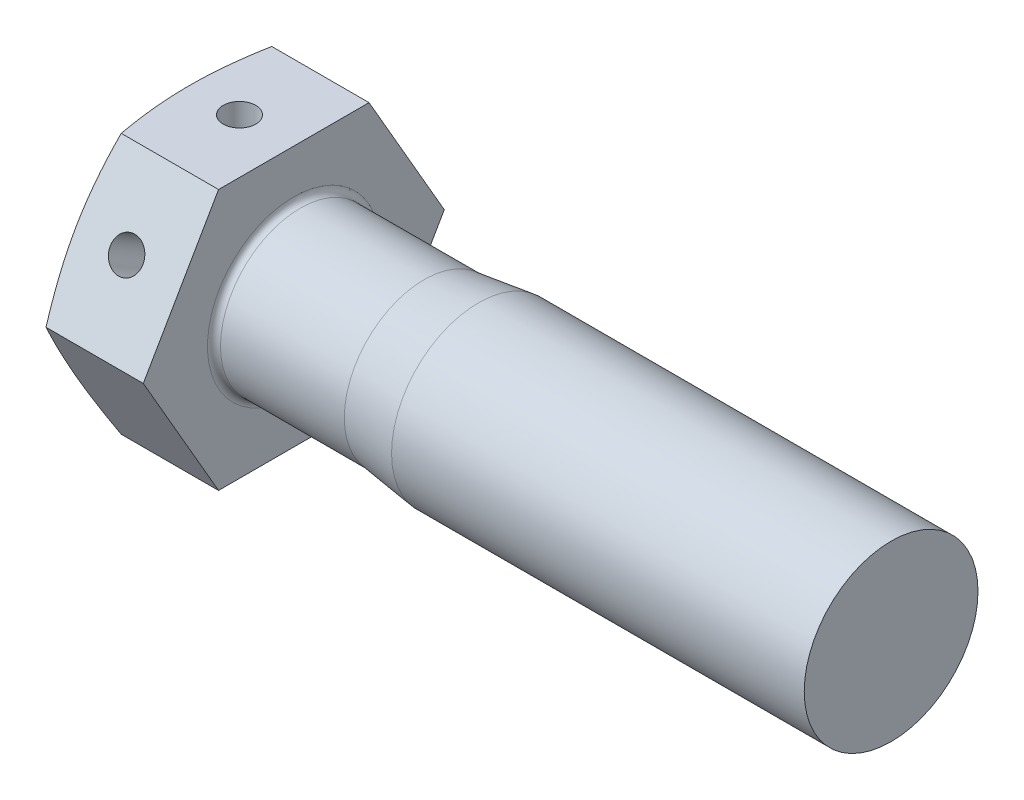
ISO-10303-21;
HEADER;
FILE_DESCRIPTION(('STEP AP214'),'2;1');
FILE_NAME('part.step','',(''),(''),'','','');
FILE_SCHEMA(('AUTOMOTIVE_DESIGN { 1 0 10303 214 1 1 1 1 }'));
ENDSEC;
DATA;
#1=APPLICATION_CONTEXT('core data for automotive mechanical design processes');
#2=APPLICATION_PROTOCOL_DEFINITION('international standard','automotive_design',2000,#1);
#3=PRODUCT_CONTEXT('',#1,'mechanical');
#4=PRODUCT('Part','Part','',(#3));
#5=PRODUCT_RELATED_PRODUCT_CATEGORY('part','',(#4));
#6=PRODUCT_DEFINITION_FORMATION('','',#4);
#7=PRODUCT_DEFINITION_CONTEXT('part definition',#1,'design');
#8=PRODUCT_DEFINITION('design','',#6,#7);
#9=PRODUCT_DEFINITION_SHAPE('','',#8);
#10=(LENGTH_UNIT() NAMED_UNIT(*) SI_UNIT(.MILLI.,.METRE.));
#11=(NAMED_UNIT(*) PLANE_ANGLE_UNIT() SI_UNIT($,.RADIAN.));
#12=(NAMED_UNIT(*) SI_UNIT($,.STERADIAN.) SOLID_ANGLE_UNIT());
#13=UNCERTAINTY_MEASURE_WITH_UNIT(LENGTH_MEASURE(1.E-05),#10,'distance_accuracy_value','');
#14=(GEOMETRIC_REPRESENTATION_CONTEXT(3) GLOBAL_UNCERTAINTY_ASSIGNED_CONTEXT((#13)) GLOBAL_UNIT_ASSIGNED_CONTEXT((#10,
#11,#12)) REPRESENTATION_CONTEXT('',''));
#15=CARTESIAN_POINT('',(0.,0.,0.));
#16=DIRECTION('',(0.,0.,1.));
#17=DIRECTION('',(1.,0.,0.));
#18=AXIS2_PLACEMENT_3D('',#15,#16,#17);
#19=CARTESIAN_POINT('',(5.,-12.,0.));
#20=DIRECTION('',(0.,1.,0.));
#21=DIRECTION('',(0.,0.,1.));
#22=AXIS2_PLACEMENT_3D('',#19,#20,#21);
#23=CYLINDRICAL_SURFACE('',#22,1.5);
#24=CARTESIAN_POINT('',(5.,12.0000000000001,0.));
#25=DIRECTION('',(0.,1.,0.));
#26=DIRECTION('',(0.,0.,1.));
#27=AXIS2_PLACEMENT_3D('',#24,#25,#26);
#28=CIRCLE('',#27,1.5);
#29=CARTESIAN_POINT('',(5.,12.0000000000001,1.5));
#30=VERTEX_POINT('',#29);
#31=EDGE_CURVE('E267',#30,#30,#28,.T.);
#32=ORIENTED_EDGE('',*,*,#31,.T.);
#33=EDGE_LOOP('',(#32));
#34=FACE_BOUND('',#33,.T.);
#35=CARTESIAN_POINT('',(5.,0.,0.));
#36=DIRECTION('',(0.,0.500000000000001,-0.866025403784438));
#37=DIRECTION('',(0.,0.866025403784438,0.500000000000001));
#38=AXIS2_PLACEMENT_3D('',#35,#36,#37);
#39=ELLIPSE('',#38,3.,1.5);
#40=CARTESIAN_POINT('',(6.5,0.,0.));
#41=VERTEX_POINT('',#40);
#42=CARTESIAN_POINT('',(3.5,0.,0.));
#43=VERTEX_POINT('',#42);
#44=EDGE_CURVE('E46',#41,#43,#39,.F.);
#45=ORIENTED_EDGE('',*,*,#44,.T.);
#46=CARTESIAN_POINT('',(5.,0.,0.));
#47=DIRECTION('',(0.,0.866025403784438,0.500000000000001));
#48=DIRECTION('',(0.,0.500000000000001,-0.866025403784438));
#49=AXIS2_PLACEMENT_3D('',#46,#47,#48);
#50=ELLIPSE('',#49,1.73205080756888,1.5);
#51=EDGE_CURVE('E11',#43,#41,#50,.F.);
#52=ORIENTED_EDGE('',*,*,#51,.T.);
#53=EDGE_LOOP('',(#45,#52));
#54=FACE_BOUND('',#53,.T.);
#55=ADVANCED_FACE('F32',(#34,#54),#23,.F.);
#56=CARTESIAN_POINT('',(10.,-12.,-6.92820323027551));
#57=DIRECTION('',(0.,0.5,0.866025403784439));
#58=DIRECTION('',(0.,-0.866025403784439,0.5));
#59=AXIS2_PLACEMENT_3D('',#56,#57,#58);
#60=PLANE('',#59);
#61=CARTESIAN_POINT('',(5.,-5.99999999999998,-10.3923048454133));
#62=DIRECTION('',(0.,0.5,0.866025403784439));
#63=DIRECTION('',(0.,-0.866025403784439,0.5));
#64=AXIS2_PLACEMENT_3D('',#61,#62,#63);
#65=CIRCLE('',#64,1.5);
#66=CARTESIAN_POINT('',(5.,-7.29903810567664,-9.64230484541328));
#67=VERTEX_POINT('',#66);
#68=EDGE_CURVE('E269',#67,#67,#65,.T.);
#69=ORIENTED_EDGE('',*,*,#68,.T.);
#70=EDGE_LOOP('',(#69));
#71=FACE_BOUND('',#70,.T.);
#72=CARTESIAN_POINT('',(1.03968895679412,0.000200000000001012,-13.8565219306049));
#73=CARTESIAN_POINT('',(0.935221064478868,-0.496762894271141,-13.5696002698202));
#74=CARTESIAN_POINT('',(0.840189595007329,-0.995364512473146,-13.2817324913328));
#75=CARTESIAN_POINT('',(0.672996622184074,-1.99580957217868,-12.7041252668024));
#76=CARTESIAN_POINT('',(0.600853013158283,-2.49765523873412,-12.414384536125));
#77=CARTESIAN_POINT('',(0.484162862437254,-3.49901930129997,-11.8362467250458));
#78=CARTESIAN_POINT('',(0.439361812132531,-3.99851483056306,-11.5478628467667));
#79=CARTESIAN_POINT('',(0.379271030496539,-4.99867391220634,-10.9704207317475));
#80=CARTESIAN_POINT('',(0.363970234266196,-5.49933695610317,-10.6813627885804));
#81=CARTESIAN_POINT('',(0.363970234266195,-6.50066304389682,-10.1032469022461));
#82=CARTESIAN_POINT('',(0.379271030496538,-7.00132608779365,-9.81418895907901));
#83=CARTESIAN_POINT('',(0.439361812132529,-8.00148516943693,-9.23674684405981));
#84=CARTESIAN_POINT('',(0.484162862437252,-8.50098069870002,-8.94836296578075));
#85=CARTESIAN_POINT('',(0.600853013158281,-9.50234476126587,-8.37022515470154));
#86=CARTESIAN_POINT('',(0.672996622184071,-10.0041904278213,-8.08048442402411));
#87=CARTESIAN_POINT('',(0.840189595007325,-11.0046354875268,-7.50287719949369));
#88=CARTESIAN_POINT('',(0.935221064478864,-11.5032371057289,-7.21500942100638));
#89=CARTESIAN_POINT('',(1.03968895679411,-12.0002,-6.92808776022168));
#90=B_SPLINE_CURVE_WITH_KNOTS('',3,(#72,#73,#74,#75,#76,#77,#78,#79,#80,#81,#82,#83,#84,#85,#86,
#87,#88,#89),.UNSPECIFIED.,.F.,.F.,(4,2,2,2,2,2,2,2,4),(0.,1.75000540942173,3.50137566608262,
5.23618486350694,6.97034324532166,8.70450162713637,10.4393108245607,12.1906810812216,
13.9406864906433),.UNSPECIFIED.);
#91=CARTESIAN_POINT('',(1.03964692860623,0.,-13.856406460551));
#92=VERTEX_POINT('',#91);
#93=CARTESIAN_POINT('',(1.03964692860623,-12.,-6.92820323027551));
#94=VERTEX_POINT('',#93);
#95=EDGE_CURVE('E54',#92,#94,#90,.T.);
#96=ORIENTED_EDGE('',*,*,#95,.F.);
#97=DIRECTION('',(-1.,0.,0.));
#98=VECTOR('',#97,1.);
#99=CARTESIAN_POINT('',(10.,0.,-13.856406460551));
#100=LINE('',#99,#98);
#101=CARTESIAN_POINT('',(10.,0.,-13.856406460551));
#102=VERTEX_POINT('',#101);
#103=EDGE_CURVE('E111',#102,#92,#100,.T.);
#104=ORIENTED_EDGE('',*,*,#103,.F.);
#105=DIRECTION('',(0.,0.866025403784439,-0.5));
#106=VECTOR('',#105,1.);
#107=CARTESIAN_POINT('',(10.,-12.,-6.92820323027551));
#108=LINE('',#107,#106);
#109=CARTESIAN_POINT('',(10.,-12.,-6.92820323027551));
#110=VERTEX_POINT('',#109);
#111=EDGE_CURVE('E139',#110,#102,#108,.T.);
#112=ORIENTED_EDGE('',*,*,#111,.F.);
#113=DIRECTION('',(-1.,0.,0.));
#114=VECTOR('',#113,1.);
#115=CARTESIAN_POINT('',(10.,-12.,-6.92820323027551));
#116=LINE('',#115,#114);
#117=EDGE_CURVE('E126',#110,#94,#116,.T.);
#118=ORIENTED_EDGE('',*,*,#117,.T.);
#119=EDGE_LOOP('',(#96,#104,#112,#118));
#120=FACE_BOUND('',#119,.T.);
#121=ADVANCED_FACE('F34',(#71,#120),#60,.F.);
#122=CARTESIAN_POINT('',(10.,0.,-13.856406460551));
#123=DIRECTION('',(0.,-0.5,0.866025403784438));
#124=DIRECTION('',(0.,-0.866025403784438,-0.5));
#125=AXIS2_PLACEMENT_3D('',#122,#123,#124);
#126=PLANE('',#125);
#127=CARTESIAN_POINT('',(1.03968895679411,12.0002,-6.92808776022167));
#128=CARTESIAN_POINT('',(0.935221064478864,11.5032371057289,-7.21500942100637));
#129=CARTESIAN_POINT('',(0.840189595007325,11.0046354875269,-7.50287719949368));
#130=CARTESIAN_POINT('',(0.672996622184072,10.0041904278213,-8.0804844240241));
#131=CARTESIAN_POINT('',(0.600853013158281,9.50234476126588,-8.37022515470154));
#132=CARTESIAN_POINT('',(0.484162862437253,8.50098069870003,-8.94836296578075));
#133=CARTESIAN_POINT('',(0.439361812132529,8.00148516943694,-9.23674684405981));
#134=CARTESIAN_POINT('',(0.379271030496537,7.00132608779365,-9.814188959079));
#135=CARTESIAN_POINT('',(0.363970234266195,6.50066304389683,-10.1032469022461));
#136=CARTESIAN_POINT('',(0.363970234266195,5.49933695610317,-10.6813627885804));
#137=CARTESIAN_POINT('',(0.379271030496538,4.99867391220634,-10.9704207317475));
#138=CARTESIAN_POINT('',(0.43936181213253,3.99851483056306,-11.5478628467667));
#139=CARTESIAN_POINT('',(0.484162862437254,3.49901930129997,-11.8362467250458));
#140=CARTESIAN_POINT('',(0.600853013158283,2.49765523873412,-12.414384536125));
#141=CARTESIAN_POINT('',(0.672996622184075,1.99580957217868,-12.7041252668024));
#142=CARTESIAN_POINT('',(0.840189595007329,0.995364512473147,-13.2817324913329));
#143=CARTESIAN_POINT('',(0.935221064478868,0.496762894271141,-13.5696002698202));
#144=CARTESIAN_POINT('',(1.03968895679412,-0.000200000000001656,-13.8565219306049));
#145=B_SPLINE_CURVE_WITH_KNOTS('',3,(#127,#128,#129,#130,#131,#132,#133,#134,#135,#136,#137,
#138,#139,#140,#141,#142,#143,#144),.UNSPECIFIED.,.F.,.F.,(4,2,2,2,2,2,2,2,4),(0.,
1.75000540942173,3.50137566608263,5.23618486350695,6.97034324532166,8.70450162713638,
10.4393108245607,12.1906810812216,13.9406864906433),.UNSPECIFIED.);
#146=CARTESIAN_POINT('',(1.03964692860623,12.,-6.92820323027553));
#147=VERTEX_POINT('',#146);
#148=EDGE_CURVE('E150',#147,#92,#145,.T.);
#149=ORIENTED_EDGE('',*,*,#148,.F.);
#150=DIRECTION('',(-1.,0.,0.));
#151=VECTOR('',#150,1.);
#152=CARTESIAN_POINT('',(10.,12.,-6.92820323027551));
#153=LINE('',#152,#151);
#154=CARTESIAN_POINT('',(10.,12.,-6.92820323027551));
#155=VERTEX_POINT('',#154);
#156=EDGE_CURVE('E114',#155,#147,#153,.T.);
#157=ORIENTED_EDGE('',*,*,#156,.F.);
#158=DIRECTION('',(0.,0.866025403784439,0.5));
#159=VECTOR('',#158,1.);
#160=CARTESIAN_POINT('',(10.,0.,-13.856406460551));
#161=LINE('',#160,#159);
#162=EDGE_CURVE('E137',#102,#155,#161,.T.);
#163=ORIENTED_EDGE('',*,*,#162,.F.);
#164=ORIENTED_EDGE('',*,*,#103,.T.);
#165=EDGE_LOOP('',(#149,#157,#163,#164));
#166=FACE_BOUND('',#165,.T.);
#167=ADVANCED_FACE('F200',(#166),#126,.F.);
#168=CARTESIAN_POINT('',(10.,12.,-6.92820323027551));
#169=DIRECTION('',(0.,-1.,0.));
#170=DIRECTION('',(0.,0.,-1.));
#171=AXIS2_PLACEMENT_3D('',#168,#169,#170);
#172=PLANE('',#171);
#173=ORIENTED_EDGE('',*,*,#31,.F.);
#174=EDGE_LOOP('',(#173));
#175=FACE_BOUND('',#174,.T.);
#176=CARTESIAN_POINT('',(3.96396734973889,12.,-18.3087950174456));
#177=CARTESIAN_POINT('',(3.79884886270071,12.,-17.7662249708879));
#178=CARTESIAN_POINT('',(3.63566479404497,12.,-17.2230552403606));
#179=CARTESIAN_POINT('',(3.31423573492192,12.,-16.1352111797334));
#180=CARTESIAN_POINT('',(3.15599113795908,12.,-15.5905367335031));
#181=CARTESIAN_POINT('',(2.84524590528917,12.,-14.4984381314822));
#182=CARTESIAN_POINT('',(2.69275663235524,12.,-13.951010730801));
#183=CARTESIAN_POINT('',(2.39531632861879,12.,-12.8541146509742));
#184=CARTESIAN_POINT('',(2.25036516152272,12.,-12.304646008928));
#185=CARTESIAN_POINT('',(1.97161365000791,12.,-11.2101580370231));
#186=CARTESIAN_POINT('',(1.83769693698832,12.,-10.6651684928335));
#187=CARTESIAN_POINT('',(1.58131725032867,12.,-9.57247358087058));
#188=CARTESIAN_POINT('',(1.45885446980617,12.,-9.02476816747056));
#189=CARTESIAN_POINT('',(1.22824895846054,12.,-7.92652528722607));
#190=CARTESIAN_POINT('',(1.12010122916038,12.,-7.37598887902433));
#191=CARTESIAN_POINT('',(0.921428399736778,12.,-6.2717216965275));
#192=CARTESIAN_POINT('',(0.83090270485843,12.,-5.71799103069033));
#193=CARTESIAN_POINT('',(0.680125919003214,12.,-4.66974970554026));
#194=CARTESIAN_POINT('',(0.617617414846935,12.,-4.17556679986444));
#195=CARTESIAN_POINT('',(0.511920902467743,12.,-3.18512193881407));
#196=CARTESIAN_POINT('',(0.468732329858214,12.,-2.68886004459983));
#197=CARTESIAN_POINT('',(0.403756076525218,12.,-1.69526447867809));
#198=CARTESIAN_POINT('',(0.381953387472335,12.,-1.19793180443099));
#199=CARTESIAN_POINT('',(0.360851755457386,12.,-0.202784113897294));
#200=CARTESIAN_POINT('',(0.361552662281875,12.,0.295030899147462));
#201=CARTESIAN_POINT('',(0.385481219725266,12.,1.29266481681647));
#202=CARTESIAN_POINT('',(0.40882438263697,12.,1.79248090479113));
#203=CARTESIAN_POINT('',(0.476964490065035,12.,2.79063583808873));
#204=CARTESIAN_POINT('',(0.521761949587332,12.,3.28897464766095));
#205=CARTESIAN_POINT('',(0.630722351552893,12.,4.28393280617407));
#206=CARTESIAN_POINT('',(0.694901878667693,12.,4.78055031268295));
#207=CARTESIAN_POINT('',(0.8400332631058,12.,5.7713005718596));
#208=CARTESIAN_POINT('',(0.920985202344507,12.,6.26543331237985));
#209=CARTESIAN_POINT('',(1.10220294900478,12.,7.28006763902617));
#210=CARTESIAN_POINT('',(1.2033232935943,12.,7.80041525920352));
#211=CARTESIAN_POINT('',(1.41857818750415,12.,8.83842892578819));
#212=CARTESIAN_POINT('',(1.53271372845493,12.,9.35609476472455));
#213=CARTESIAN_POINT('',(1.77159173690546,12.,10.3891186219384));
#214=CARTESIAN_POINT('',(1.89633731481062,12.,10.904475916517));
#215=CARTESIAN_POINT('',(2.15439952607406,12.,11.9330162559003));
#216=CARTESIAN_POINT('',(2.28771595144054,12.,12.4461993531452));
#217=CARTESIAN_POINT('',(2.56148831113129,12.,13.4713608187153));
#218=CARTESIAN_POINT('',(2.70195324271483,12.,13.9833367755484));
#219=CARTESIAN_POINT('',(2.98857841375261,12.,15.0056897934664));
#220=CARTESIAN_POINT('',(3.1347386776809,12.,15.5160668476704));
#221=CARTESIAN_POINT('',(3.43170649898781,12.,16.5353680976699));
#222=CARTESIAN_POINT('',(3.58251324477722,12.,17.0442925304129));
#223=CARTESIAN_POINT('',(3.88799531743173,12.,18.0609803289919));
#224=CARTESIAN_POINT('',(4.04267066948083,12.,18.5687436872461));
#225=CARTESIAN_POINT('',(4.5079543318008,12.,20.0790517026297));
#226=CARTESIAN_POINT('',(4.82321954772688,12.,21.0801614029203));
#227=CARTESIAN_POINT('',(5.46263375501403,12.,23.0795787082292));
#228=CARTESIAN_POINT('',(5.78678317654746,12.,24.0778861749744));
#229=CARTESIAN_POINT('',(6.44034806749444,12.,26.0685686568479));
#230=CARTESIAN_POINT('',(6.76973882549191,12.,27.0609517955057));
#231=CARTESIAN_POINT('',(7.26745556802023,12.,28.5482638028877));
#232=CARTESIAN_POINT('',(7.43395945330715,12.,29.0438040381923));
#233=CARTESIAN_POINT('',(7.768037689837,12.,30.0345222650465));
#234=CARTESIAN_POINT('',(7.93561203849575,12.,30.5297002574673));
#235=CARTESIAN_POINT('',(8.10365001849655,12.,31.02472094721));
#236=B_SPLINE_CURVE_WITH_KNOTS('',3,(#176,#177,#178,#179,#180,#181,#182,#183,#184,#185,#186,
#187,#188,#189,#190,#191,#192,#193,#194,#195,#196,#197,#198,#199,#200,#201,#202,#203,#204,#205,
#206,#207,#208,#209,#210,#211,#212,#213,#214,#215,#216,#217,#218,#219,#220,#221,#222,#223,#224,
#225,#226,#227,#228,#229,#230,#231,#232,#233,#234,#235),.UNSPECIFIED.,.F.,.F.,(4,2,2,2,2,2,2,2,
2,2,2,2,2,2,2,2,2,2,2,2,2,2,2,2,2,2,2,2,2,4),(0.,1.70142841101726,3.40299202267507,
5.10775586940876,6.81248888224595,8.49599601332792,10.1795315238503,11.8624776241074,
13.5453669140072,15.0393995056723,16.5333884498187,18.0263281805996,19.5192579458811,
21.019844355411,22.5204667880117,24.0223769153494,25.524294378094,27.1143358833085,
28.7044986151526,30.2951291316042,31.8857210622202,33.4783669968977,35.0710197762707,
36.6633959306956,38.2557824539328,41.4044472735,44.5532648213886,47.6901088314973,
49.2584041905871,50.8266957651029),.UNSPECIFIED.);
#237=CARTESIAN_POINT('',(1.03964692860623,12.0000000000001,6.92820323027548));
#238=VERTEX_POINT('',#237);
#239=EDGE_CURVE('E191',#238,#147,#236,.F.);
#240=ORIENTED_EDGE('',*,*,#239,.F.);
#241=DIRECTION('',(-1.,0.,0.));
#242=VECTOR('',#241,1.);
#243=CARTESIAN_POINT('',(10.,12.,6.92820323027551));
#244=LINE('',#243,#242);
#245=CARTESIAN_POINT('',(10.,12.,6.92820323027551));
#246=VERTEX_POINT('',#245);
#247=EDGE_CURVE('E117',#246,#238,#244,.T.);
#248=ORIENTED_EDGE('',*,*,#247,.F.);
#249=DIRECTION('',(0.,0.,1.));
#250=VECTOR('',#249,1.);
#251=CARTESIAN_POINT('',(10.,12.,-6.92820323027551));
#252=LINE('',#251,#250);
#253=EDGE_CURVE('E135',#155,#246,#252,.T.);
#254=ORIENTED_EDGE('',*,*,#253,.F.);
#255=ORIENTED_EDGE('',*,*,#156,.T.);
#256=EDGE_LOOP('',(#240,#248,#254,#255));
#257=FACE_BOUND('',#256,.T.);
#258=ADVANCED_FACE('F196',(#175,#257),#172,.F.);
#259=CARTESIAN_POINT('',(10.,12.,6.92820323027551));
#260=DIRECTION('',(0.,-0.5,-0.866025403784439));
#261=DIRECTION('',(0.,0.866025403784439,-0.5));
#262=AXIS2_PLACEMENT_3D('',#259,#260,#261);
#263=PLANE('',#262);
#264=CARTESIAN_POINT('',(5.,5.99999999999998,10.3923048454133));
#265=DIRECTION('',(0.,-0.5,-0.866025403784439));
#266=DIRECTION('',(0.,0.866025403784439,-0.5));
#267=AXIS2_PLACEMENT_3D('',#264,#265,#266);
#268=CIRCLE('',#267,1.5);
#269=CARTESIAN_POINT('',(5.,7.29903810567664,9.64230484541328));
#270=VERTEX_POINT('',#269);
#271=EDGE_CURVE('E272',#270,#270,#268,.T.);
#272=ORIENTED_EDGE('',*,*,#271,.T.);
#273=EDGE_LOOP('',(#272));
#274=FACE_BOUND('',#273,.T.);
#275=CARTESIAN_POINT('',(1.03968895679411,-0.000199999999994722,13.8565219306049));
#276=CARTESIAN_POINT('',(0.935221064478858,0.496762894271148,13.5696002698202));
#277=CARTESIAN_POINT('',(0.840189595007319,0.995364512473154,13.2817324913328));
#278=CARTESIAN_POINT('',(0.672996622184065,1.99580957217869,12.7041252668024));
#279=CARTESIAN_POINT('',(0.600853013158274,2.49765523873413,12.414384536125));
#280=CARTESIAN_POINT('',(0.484162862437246,3.49901930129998,11.8362467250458));
#281=CARTESIAN_POINT('',(0.439361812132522,3.99851483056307,11.5478628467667));
#282=CARTESIAN_POINT('',(0.37927103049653,4.99867391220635,10.9704207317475));
#283=CARTESIAN_POINT('',(0.363970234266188,5.49933695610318,10.6813627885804));
#284=CARTESIAN_POINT('',(0.363970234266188,6.50066304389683,10.1032469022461));
#285=CARTESIAN_POINT('',(0.379271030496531,7.00132608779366,9.814188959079));
#286=CARTESIAN_POINT('',(0.439361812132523,8.00148516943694,9.23674684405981));
#287=CARTESIAN_POINT('',(0.484162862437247,8.50098069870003,8.94836296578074));
#288=CARTESIAN_POINT('',(0.600853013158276,9.50234476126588,8.37022515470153));
#289=CARTESIAN_POINT('',(0.672996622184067,10.0041904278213,8.0804844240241));
#290=CARTESIAN_POINT('',(0.840189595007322,11.0046354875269,7.50287719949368));
#291=CARTESIAN_POINT('',(0.935221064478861,11.5032371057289,7.21500942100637));
#292=CARTESIAN_POINT('',(1.03968895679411,12.0002,6.92808776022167));
#293=B_SPLINE_CURVE_WITH_KNOTS('',3,(#275,#276,#277,#278,#279,#280,#281,#282,#283,#284,#285,
#286,#287,#288,#289,#290,#291,#292),.UNSPECIFIED.,.F.,.F.,(4,2,2,2,2,2,2,2,4),(0.,
1.75000540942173,3.50137566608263,5.23618486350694,6.97034324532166,8.70450162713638,
10.4393108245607,12.1906810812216,13.9406864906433),.UNSPECIFIED.);
#294=CARTESIAN_POINT('',(1.03964692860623,0.,13.8564064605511));
#295=VERTEX_POINT('',#294);
#296=EDGE_CURVE('E186',#295,#238,#293,.T.);
#297=ORIENTED_EDGE('',*,*,#296,.F.);
#298=DIRECTION('',(-1.,0.,0.));
#299=VECTOR('',#298,1.);
#300=CARTESIAN_POINT('',(10.,0.,13.856406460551));
#301=LINE('',#300,#299);
#302=CARTESIAN_POINT('',(10.,0.,13.856406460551));
#303=VERTEX_POINT('',#302);
#304=EDGE_CURVE('E120',#303,#295,#301,.T.);
#305=ORIENTED_EDGE('',*,*,#304,.F.);
#306=DIRECTION('',(0.,-0.866025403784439,0.5));
#307=VECTOR('',#306,1.);
#308=CARTESIAN_POINT('',(10.,12.,6.92820323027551));
#309=LINE('',#308,#307);
#310=EDGE_CURVE('E133',#246,#303,#309,.T.);
#311=ORIENTED_EDGE('',*,*,#310,.F.);
#312=ORIENTED_EDGE('',*,*,#247,.T.);
#313=EDGE_LOOP('',(#297,#305,#311,#312));
#314=FACE_BOUND('',#313,.T.);
#315=ADVANCED_FACE('F199',(#274,#314),#263,.F.);
#316=CARTESIAN_POINT('',(10.,0.,13.856406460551));
#317=DIRECTION('',(0.,0.5,-0.866025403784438));
#318=DIRECTION('',(0.,0.866025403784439,0.5));
#319=AXIS2_PLACEMENT_3D('',#316,#317,#318);
#320=PLANE('',#319);
#321=CARTESIAN_POINT('',(1.03968895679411,-12.0002,6.92808776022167));
#322=CARTESIAN_POINT('',(0.935221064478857,-11.5032371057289,7.21500942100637));
#323=CARTESIAN_POINT('',(0.840189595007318,-11.0046354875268,7.50287719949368));
#324=CARTESIAN_POINT('',(0.672996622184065,-10.0041904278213,8.0804844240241));
#325=CARTESIAN_POINT('',(0.600853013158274,-9.50234476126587,8.37022515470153));
#326=CARTESIAN_POINT('',(0.484162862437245,-8.50098069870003,8.94836296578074));
#327=CARTESIAN_POINT('',(0.43936181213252,-8.00148516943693,9.2367468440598));
#328=CARTESIAN_POINT('',(0.379271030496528,-7.00132608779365,9.814188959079));
#329=CARTESIAN_POINT('',(0.363970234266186,-6.50066304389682,10.1032469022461));
#330=CARTESIAN_POINT('',(0.363970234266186,-5.49933695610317,10.6813627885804));
#331=CARTESIAN_POINT('',(0.379271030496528,-4.99867391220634,10.9704207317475));
#332=CARTESIAN_POINT('',(0.43936181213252,-3.99851483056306,11.5478628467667));
#333=CARTESIAN_POINT('',(0.484162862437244,-3.49901930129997,11.8362467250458));
#334=CARTESIAN_POINT('',(0.600853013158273,-2.49765523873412,12.414384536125));
#335=CARTESIAN_POINT('',(0.672996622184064,-1.99580957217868,12.7041252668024));
#336=CARTESIAN_POINT('',(0.840189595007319,-0.995364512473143,13.2817324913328));
#337=CARTESIAN_POINT('',(0.935221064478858,-0.496762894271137,13.5696002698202));
#338=CARTESIAN_POINT('',(1.03968895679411,0.000200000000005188,13.8565219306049));
#339=B_SPLINE_CURVE_WITH_KNOTS('',3,(#321,#322,#323,#324,#325,#326,#327,#328,#329,#330,#331,
#332,#333,#334,#335,#336,#337,#338),.UNSPECIFIED.,.F.,.F.,(4,2,2,2,2,2,2,2,4),(0.,
1.75000540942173,3.50137566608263,5.23618486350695,6.97034324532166,8.70450162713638,
10.4393108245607,12.1906810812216,13.9406864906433),.UNSPECIFIED.);
#340=CARTESIAN_POINT('',(1.03964692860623,-12.,6.92820323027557));
#341=VERTEX_POINT('',#340);
#342=EDGE_CURVE('E179',#341,#295,#339,.T.);
#343=ORIENTED_EDGE('',*,*,#342,.F.);
#344=DIRECTION('',(-1.,0.,0.));
#345=VECTOR('',#344,1.);
#346=CARTESIAN_POINT('',(10.,-12.,6.9282032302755));
#347=LINE('',#346,#345);
#348=CARTESIAN_POINT('',(10.,-12.,6.9282032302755));
#349=VERTEX_POINT('',#348);
#350=EDGE_CURVE('E123',#349,#341,#347,.T.);
#351=ORIENTED_EDGE('',*,*,#350,.F.);
#352=DIRECTION('',(0.,-0.866025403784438,-0.5));
#353=VECTOR('',#352,1.);
#354=CARTESIAN_POINT('',(10.,0.,13.856406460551));
#355=LINE('',#354,#353);
#356=EDGE_CURVE('E131',#303,#349,#355,.T.);
#357=ORIENTED_EDGE('',*,*,#356,.F.);
#358=ORIENTED_EDGE('',*,*,#304,.T.);
#359=EDGE_LOOP('',(#343,#351,#357,#358));
#360=FACE_BOUND('',#359,.T.);
#361=ADVANCED_FACE('F278',(#360),#320,.F.);
#362=CARTESIAN_POINT('',(10.,-12.,6.9282032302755));
#363=DIRECTION('',(0.,1.,0.));
#364=DIRECTION('',(0.,0.,1.));
#365=AXIS2_PLACEMENT_3D('',#362,#363,#364);
#366=PLANE('',#365);
#367=CARTESIAN_POINT('',(5.,-12.,0.));
#368=DIRECTION('',(0.,1.,0.));
#369=DIRECTION('',(0.,0.,1.));
#370=AXIS2_PLACEMENT_3D('',#367,#368,#369);
#371=CIRCLE('',#370,1.5);
#372=CARTESIAN_POINT('',(5.,-12.,1.5));
#373=VERTEX_POINT('',#372);
#374=EDGE_CURVE('E264',#373,#373,#371,.T.);
#375=ORIENTED_EDGE('',*,*,#374,.T.);
#376=EDGE_LOOP('',(#375));
#377=FACE_BOUND('',#376,.T.);
#378=CARTESIAN_POINT('',(3.96396734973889,-12.,-18.3087950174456));
#379=CARTESIAN_POINT('',(3.79884886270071,-12.,-17.7662249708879));
#380=CARTESIAN_POINT('',(3.63566479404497,-12.,-17.2230552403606));
#381=CARTESIAN_POINT('',(3.31423573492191,-12.,-16.1352111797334));
#382=CARTESIAN_POINT('',(3.15599113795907,-12.,-15.5905367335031));
#383=CARTESIAN_POINT('',(2.84524590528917,-12.,-14.4984381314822));
#384=CARTESIAN_POINT('',(2.69275663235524,-12.,-13.9510107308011));
#385=CARTESIAN_POINT('',(2.39531632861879,-12.,-12.8541146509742));
#386=CARTESIAN_POINT('',(2.25036516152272,-12.,-12.304646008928));
#387=CARTESIAN_POINT('',(1.97161365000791,-12.,-11.2101580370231));
#388=CARTESIAN_POINT('',(1.83769693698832,-12.,-10.6651684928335));
#389=CARTESIAN_POINT('',(1.58131725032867,-12.,-9.57247358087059));
#390=CARTESIAN_POINT('',(1.45885446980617,-12.,-9.02476816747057));
#391=CARTESIAN_POINT('',(1.22824895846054,-12.,-7.92652528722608));
#392=CARTESIAN_POINT('',(1.12010122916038,-12.,-7.37598887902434));
#393=CARTESIAN_POINT('',(0.921428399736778,-12.,-6.27172169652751));
#394=CARTESIAN_POINT('',(0.83090270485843,-12.,-5.71799103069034));
#395=CARTESIAN_POINT('',(0.680125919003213,-12.,-4.66974970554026));
#396=CARTESIAN_POINT('',(0.617617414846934,-12.,-4.17556679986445));
#397=CARTESIAN_POINT('',(0.511920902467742,-12.,-3.18512193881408));
#398=CARTESIAN_POINT('',(0.468732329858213,-12.,-2.68886004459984));
#399=CARTESIAN_POINT('',(0.403756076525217,-12.,-1.6952644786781));
#400=CARTESIAN_POINT('',(0.381953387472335,-12.,-1.197931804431));
#401=CARTESIAN_POINT('',(0.360851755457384,-12.,-0.202784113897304));
#402=CARTESIAN_POINT('',(0.361552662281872,-12.,0.295030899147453));
#403=CARTESIAN_POINT('',(0.385481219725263,-12.,1.29266481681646));
#404=CARTESIAN_POINT('',(0.408824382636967,-12.,1.79248090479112));
#405=CARTESIAN_POINT('',(0.476964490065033,-12.,2.79063583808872));
#406=CARTESIAN_POINT('',(0.521761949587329,-12.,3.28897464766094));
#407=CARTESIAN_POINT('',(0.63072235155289,-12.,4.28393280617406));
#408=CARTESIAN_POINT('',(0.694901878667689,-12.,4.78055031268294));
#409=CARTESIAN_POINT('',(0.840033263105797,-12.,5.77130057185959));
#410=CARTESIAN_POINT('',(0.920985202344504,-12.,6.26543331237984));
#411=CARTESIAN_POINT('',(1.10220294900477,-12.,7.28006763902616));
#412=CARTESIAN_POINT('',(1.20332329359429,-12.,7.80041525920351));
#413=CARTESIAN_POINT('',(1.41857818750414,-12.,8.83842892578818));
#414=CARTESIAN_POINT('',(1.53271372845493,-12.,9.35609476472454));
#415=CARTESIAN_POINT('',(1.77159173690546,-12.,10.3891186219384));
#416=CARTESIAN_POINT('',(1.89633731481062,-12.,10.904475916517));
#417=CARTESIAN_POINT('',(2.15439952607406,-12.,11.9330162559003));
#418=CARTESIAN_POINT('',(2.28771595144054,-12.,12.4461993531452));
#419=CARTESIAN_POINT('',(2.56148831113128,-12.,13.4713608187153));
#420=CARTESIAN_POINT('',(2.70195324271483,-12.,13.9833367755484));
#421=CARTESIAN_POINT('',(2.9885784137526,-12.,15.0056897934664));
#422=CARTESIAN_POINT('',(3.1347386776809,-12.,15.5160668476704));
#423=CARTESIAN_POINT('',(3.4317064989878,-12.,16.5353680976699));
#424=CARTESIAN_POINT('',(3.58251324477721,-12.,17.0442925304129));
#425=CARTESIAN_POINT('',(3.88799531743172,-12.,18.0609803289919));
#426=CARTESIAN_POINT('',(4.04267066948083,-12.,18.568743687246));
#427=CARTESIAN_POINT('',(4.5079543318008,-12.,20.0790517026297));
#428=CARTESIAN_POINT('',(4.82321954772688,-12.,21.0801614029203));
#429=CARTESIAN_POINT('',(5.46263375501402,-12.,23.0795787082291));
#430=CARTESIAN_POINT('',(5.78678317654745,-12.,24.0778861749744));
#431=CARTESIAN_POINT('',(6.44034806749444,-12.,26.0685686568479));
#432=CARTESIAN_POINT('',(6.7697388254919,-12.,27.0609517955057));
#433=CARTESIAN_POINT('',(7.26745556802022,-12.,28.5482638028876));
#434=CARTESIAN_POINT('',(7.43395945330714,-12.,29.0438040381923));
#435=CARTESIAN_POINT('',(7.768037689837,-12.,30.0345222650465));
#436=CARTESIAN_POINT('',(7.93561203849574,-12.,30.5297002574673));
#437=CARTESIAN_POINT('',(8.10365001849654,-12.,31.02472094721));
#438=B_SPLINE_CURVE_WITH_KNOTS('',3,(#378,#379,#380,#381,#382,#383,#384,#385,#386,#387,#388,
#389,#390,#391,#392,#393,#394,#395,#396,#397,#398,#399,#400,#401,#402,#403,#404,#405,#406,#407,
#408,#409,#410,#411,#412,#413,#414,#415,#416,#417,#418,#419,#420,#421,#422,#423,#424,#425,#426,
#427,#428,#429,#430,#431,#432,#433,#434,#435,#436,#437),.UNSPECIFIED.,.F.,.F.,(4,2,2,2,2,2,2,2,
2,2,2,2,2,2,2,2,2,2,2,2,2,2,2,2,2,2,2,2,2,4),(0.,1.70142841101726,3.40299202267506,
5.10775586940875,6.81248888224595,8.49599601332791,10.1795315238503,11.8624776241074,
13.5453669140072,15.0393995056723,16.5333884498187,18.0263281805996,19.5192579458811,
21.019844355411,22.5204667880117,24.0223769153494,25.524294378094,27.1143358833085,
28.7044986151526,30.2951291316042,31.8857210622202,33.4783669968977,35.0710197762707,
36.6633959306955,38.2557824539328,41.4044472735,44.5532648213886,47.6901088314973,
49.2584041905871,50.8266957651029),.UNSPECIFIED.);
#439=EDGE_CURVE('E170',#94,#341,#438,.T.);
#440=ORIENTED_EDGE('',*,*,#439,.F.);
#441=ORIENTED_EDGE('',*,*,#117,.F.);
#442=DIRECTION('',(0.,0.,-1.));
#443=VECTOR('',#442,1.);
#444=CARTESIAN_POINT('',(10.,-12.,6.9282032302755));
#445=LINE('',#444,#443);
#446=EDGE_CURVE('E129',#349,#110,#445,.T.);
#447=ORIENTED_EDGE('',*,*,#446,.F.);
#448=ORIENTED_EDGE('',*,*,#350,.T.);
#449=EDGE_LOOP('',(#440,#441,#447,#448));
#450=FACE_BOUND('',#449,.T.);
#451=ADVANCED_FACE('F298',(#377,#450),#366,.F.);
#452=CARTESIAN_POINT('',(10.,0.,-13.856406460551));
#453=DIRECTION('',(1.,0.,0.));
#454=DIRECTION('',(0.,0.,-1.));
#455=AXIS2_PLACEMENT_3D('',#452,#453,#454);
#456=PLANE('',#455);
#457=CARTESIAN_POINT('',(10.,0.,0.));
#458=DIRECTION('',(1.,0.,0.));
#459=DIRECTION('',(0.,0.,-1.));
#460=AXIS2_PLACEMENT_3D('',#457,#458,#459);
#461=CIRCLE('',#460,7.9505);
#462=CARTESIAN_POINT('',(10.,0.,-7.9505));
#463=VERTEX_POINT('',#462);
#464=EDGE_CURVE('E108',#463,#463,#461,.F.);
#465=ORIENTED_EDGE('',*,*,#464,.T.);
#466=EDGE_LOOP('',(#465));
#467=FACE_BOUND('',#466,.T.);
#468=ORIENTED_EDGE('',*,*,#111,.T.);
#469=ORIENTED_EDGE('',*,*,#162,.T.);
#470=ORIENTED_EDGE('',*,*,#253,.T.);
#471=ORIENTED_EDGE('',*,*,#310,.T.);
#472=ORIENTED_EDGE('',*,*,#356,.T.);
#473=ORIENTED_EDGE('',*,*,#446,.T.);
#474=EDGE_LOOP('',(#468,#469,#470,#471,#472,#473));
#475=FACE_BOUND('',#474,.T.);
#476=ADVANCED_FACE('F161',(#467,#475),#456,.T.);
#477=CARTESIAN_POINT('',(0.,0.,0.));
#478=DIRECTION('',(1.,0.,0.));
#479=DIRECTION('',(0.,0.,-1.));
#480=AXIS2_PLACEMENT_3D('',#477,#478,#479);
#481=CONICAL_SURFACE('',#480,11.,1.22173047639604);
#482=CARTESIAN_POINT('',(0.,0.,0.));
#483=DIRECTION('',(-1.,0.,0.));
#484=DIRECTION('',(0.,0.,1.));
#485=AXIS2_PLACEMENT_3D('',#482,#483,#484);
#486=CIRCLE('',#485,11.);
#487=CARTESIAN_POINT('',(0.,0.,11.));
#488=VERTEX_POINT('',#487);
#489=EDGE_CURVE('E251',#488,#488,#486,.T.);
#490=ORIENTED_EDGE('',*,*,#489,.F.);
#491=EDGE_LOOP('',(#490));
#492=FACE_BOUND('',#491,.T.);
#493=ORIENTED_EDGE('',*,*,#95,.T.);
#494=ORIENTED_EDGE('',*,*,#439,.T.);
#495=ORIENTED_EDGE('',*,*,#342,.T.);
#496=ORIENTED_EDGE('',*,*,#296,.T.);
#497=ORIENTED_EDGE('',*,*,#239,.T.);
#498=ORIENTED_EDGE('',*,*,#148,.T.);
#499=EDGE_LOOP('',(#493,#494,#495,#496,#497,#498));
#500=FACE_BOUND('',#499,.T.);
#501=ADVANCED_FACE('F155',(#492,#500),#481,.T.);
#502=CARTESIAN_POINT('',(0.,0.,-13.856406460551));
#503=DIRECTION('',(1.,0.,0.));
#504=DIRECTION('',(0.,0.,-1.));
#505=AXIS2_PLACEMENT_3D('',#502,#503,#504);
#506=PLANE('',#505);
#507=CARTESIAN_POINT('',(0.,0.,0.));
#508=DIRECTION('',(-1.,0.,0.));
#509=DIRECTION('',(0.,0.,1.));
#510=AXIS2_PLACEMENT_3D('',#507,#508,#509);
#511=CIRCLE('',#510,8.85);
#512=CARTESIAN_POINT('',(0.,0.,8.85));
#513=VERTEX_POINT('',#512);
#514=EDGE_CURVE('E252',#513,#513,#511,.T.);
#515=ORIENTED_EDGE('',*,*,#514,.F.);
#516=EDGE_LOOP('',(#515));
#517=FACE_BOUND('',#516,.T.);
#518=ORIENTED_EDGE('',*,*,#489,.T.);
#519=EDGE_LOOP('',(#518));
#520=FACE_BOUND('',#519,.T.);
#521=ADVANCED_FACE('F160',(#517,#520),#506,.F.);
#522=CARTESIAN_POINT('',(2.,0.,0.));
#523=DIRECTION('',(-1.,0.,0.));
#524=DIRECTION('',(0.,0.,1.));
#525=AXIS2_PLACEMENT_3D('',#522,#523,#524);
#526=CYLINDRICAL_SURFACE('',#525,8.85);
#527=CARTESIAN_POINT('',(2.,0.,0.));
#528=DIRECTION('',(-1.,0.,0.));
#529=DIRECTION('',(0.,0.,1.));
#530=AXIS2_PLACEMENT_3D('',#527,#528,#529);
#531=CIRCLE('',#530,8.85);
#532=CARTESIAN_POINT('',(2.,0.,8.85));
#533=VERTEX_POINT('',#532);
#534=EDGE_CURVE('E250',#533,#533,#531,.T.);
#535=ORIENTED_EDGE('',*,*,#534,.F.);
#536=EDGE_LOOP('',(#535));
#537=FACE_BOUND('',#536,.T.);
#538=ORIENTED_EDGE('',*,*,#514,.T.);
#539=EDGE_LOOP('',(#538));
#540=FACE_BOUND('',#539,.T.);
#541=ADVANCED_FACE('F163',(#537,#540),#526,.F.);
#542=CARTESIAN_POINT('',(2.,0.,0.));
#543=DIRECTION('',(-1.,0.,0.));
#544=DIRECTION('',(0.,0.,1.));
#545=AXIS2_PLACEMENT_3D('',#542,#543,#544);
#546=PLANE('',#545);
#547=ORIENTED_EDGE('',*,*,#534,.T.);
#548=EDGE_LOOP('',(#547));
#549=FACE_BOUND('',#548,.T.);
#550=ADVANCED_FACE('F240',(#549),#546,.T.);
#551=CARTESIAN_POINT('',(22.,0.,0.));
#552=DIRECTION('',(1.,0.,0.));
#553=DIRECTION('',(0.,0.,-1.));
#554=AXIS2_PLACEMENT_3D('',#551,#552,#553);
#555=CONICAL_SURFACE('',#554,7.3505,0.129176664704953);
#556=CARTESIAN_POINT('',(27.,0.,0.));
#557=DIRECTION('',(-1.,0.,0.));
#558=DIRECTION('',(0.,0.,1.));
#559=AXIS2_PLACEMENT_3D('',#556,#557,#558);
#560=CIRCLE('',#559,8.);
#561=CARTESIAN_POINT('',(27.,0.,7.99999999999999));
#562=VERTEX_POINT('',#561);
#563=EDGE_CURVE('E256',#562,#562,#560,.T.);
#564=ORIENTED_EDGE('',*,*,#563,.T.);
#565=EDGE_LOOP('',(#564));
#566=FACE_BOUND('',#565,.T.);
#567=CARTESIAN_POINT('',(22.,0.,0.));
#568=DIRECTION('',(-1.,0.,0.));
#569=DIRECTION('',(0.,0.,1.));
#570=AXIS2_PLACEMENT_3D('',#567,#568,#569);
#571=CIRCLE('',#570,7.3505);
#572=CARTESIAN_POINT('',(22.,0.,7.3505));
#573=VERTEX_POINT('',#572);
#574=EDGE_CURVE('E261',#573,#573,#571,.T.);
#575=ORIENTED_EDGE('',*,*,#574,.F.);
#576=EDGE_LOOP('',(#575));
#577=FACE_BOUND('',#576,.T.);
#578=ADVANCED_FACE('F237',(#566,#577),#555,.T.);
#579=CARTESIAN_POINT('',(-2.69717570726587,0.,0.));
#580=DIRECTION('',(-1.,0.,0.));
#581=DIRECTION('',(0.,0.,1.));
#582=AXIS2_PLACEMENT_3D('',#579,#580,#581);
#583=CYLINDRICAL_SURFACE('',#582,7.3505);
#584=CARTESIAN_POINT('',(10.6,0.,0.));
#585=DIRECTION('',(1.,0.,0.));
#586=DIRECTION('',(0.,0.,-1.));
#587=AXIS2_PLACEMENT_3D('',#584,#585,#586);
#588=CIRCLE('',#587,7.3505);
#589=CARTESIAN_POINT('',(10.6,0.,-7.3505));
#590=VERTEX_POINT('',#589);
#591=EDGE_CURVE('E101',#590,#590,#588,.T.);
#592=ORIENTED_EDGE('',*,*,#591,.T.);
#593=EDGE_LOOP('',(#592));
#594=FACE_BOUND('',#593,.T.);
#595=ORIENTED_EDGE('',*,*,#574,.T.);
#596=EDGE_LOOP('',(#595));
#597=FACE_BOUND('',#596,.T.);
#598=ADVANCED_FACE('F234',(#594,#597),#583,.T.);
#599=CARTESIAN_POINT('',(65.,0.,0.));
#600=DIRECTION('',(1.,0.,0.));
#601=DIRECTION('',(0.,0.,-1.));
#602=AXIS2_PLACEMENT_3D('',#599,#600,#601);
#603=PLANE('',#602);
#604=CARTESIAN_POINT('',(65.,0.,0.));
#605=DIRECTION('',(1.,0.,0.));
#606=DIRECTION('',(0.,0.,-1.));
#607=AXIS2_PLACEMENT_3D('',#604,#605,#606);
#608=CIRCLE('',#607,8.);
#609=CARTESIAN_POINT('',(65.,0.,-8.));
#610=VERTEX_POINT('',#609);
#611=EDGE_CURVE('E142',#610,#610,#608,.T.);
#612=ORIENTED_EDGE('',*,*,#611,.T.);
#613=EDGE_LOOP('',(#612));
#614=FACE_BOUND('',#613,.T.);
#615=ADVANCED_FACE('F165',(#614),#603,.T.);
#616=CARTESIAN_POINT('',(65.,0.,0.));
#617=DIRECTION('',(-1.,0.,0.));
#618=DIRECTION('',(0.,0.,1.));
#619=AXIS2_PLACEMENT_3D('',#616,#617,#618);
#620=CYLINDRICAL_SURFACE('',#619,8.);
#621=ORIENTED_EDGE('',*,*,#611,.F.);
#622=EDGE_LOOP('',(#621));
#623=FACE_BOUND('',#622,.T.);
#624=ORIENTED_EDGE('',*,*,#563,.F.);
#625=EDGE_LOOP('',(#624));
#626=FACE_BOUND('',#625,.T.);
#627=ADVANCED_FACE('F225',(#623,#626),#620,.T.);
#628=CARTESIAN_POINT('',(10.6,0.,0.));
#629=DIRECTION('',(1.,0.,0.));
#630=DIRECTION('',(0.,0.,-1.));
#631=AXIS2_PLACEMENT_3D('',#628,#629,#630);
#632=TOROIDAL_SURFACE('',#631,7.9505,0.6);
#633=ORIENTED_EDGE('',*,*,#591,.F.);
#634=EDGE_LOOP('',(#633));
#635=FACE_BOUND('',#634,.T.);
#636=ORIENTED_EDGE('',*,*,#464,.F.);
#637=EDGE_LOOP('',(#636));
#638=FACE_BOUND('',#637,.T.);
#639=ADVANCED_FACE('F220',(#635,#638),#632,.F.);
#640=CARTESIAN_POINT('',(5.,0.,0.));
#641=DIRECTION('',(0.,0.500000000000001,-0.866025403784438));
#642=DIRECTION('',(0.,0.866025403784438,0.500000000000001));
#643=AXIS2_PLACEMENT_3D('',#640,#641,#642);
#644=ELLIPSE('',#643,3.,1.5);
#645=EDGE_CURVE('E92',#41,#43,#644,.T.);
#646=ORIENTED_EDGE('',*,*,#645,.T.);
#647=CARTESIAN_POINT('',(5.,0.,0.));
#648=DIRECTION('',(0.,0.866025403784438,0.500000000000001));
#649=DIRECTION('',(0.,0.500000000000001,-0.866025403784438));
#650=AXIS2_PLACEMENT_3D('',#647,#648,#649);
#651=ELLIPSE('',#650,1.73205080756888,1.5);
#652=EDGE_CURVE('E41',#43,#41,#651,.T.);
#653=ORIENTED_EDGE('',*,*,#652,.T.);
#654=EDGE_LOOP('',(#646,#653));
#655=FACE_BOUND('',#654,.T.);
#656=ORIENTED_EDGE('',*,*,#374,.F.);
#657=EDGE_LOOP('',(#656));
#658=FACE_BOUND('',#657,.T.);
#659=ADVANCED_FACE('F103',(#655,#658),#23,.F.);
#660=CARTESIAN_POINT('',(5.,-8.99999999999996,-15.5884572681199));
#661=DIRECTION('',(0.,0.499999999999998,0.86602540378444));
#662=DIRECTION('',(0.,-0.86602540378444,0.499999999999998));
#663=AXIS2_PLACEMENT_3D('',#660,#661,#662);
#664=CYLINDRICAL_SURFACE('',#663,1.5);
#665=ORIENTED_EDGE('',*,*,#44,.F.);
#666=ORIENTED_EDGE('',*,*,#652,.F.);
#667=EDGE_LOOP('',(#665,#666));
#668=FACE_BOUND('',#667,.T.);
#669=ORIENTED_EDGE('',*,*,#271,.F.);
#670=EDGE_LOOP('',(#669));
#671=FACE_BOUND('',#670,.T.);
#672=ADVANCED_FACE('F99',(#668,#671),#664,.F.);
#673=ORIENTED_EDGE('',*,*,#645,.F.);
#674=ORIENTED_EDGE('',*,*,#51,.F.);
#675=EDGE_LOOP('',(#673,#674));
#676=FACE_BOUND('',#675,.T.);
#677=ORIENTED_EDGE('',*,*,#68,.F.);
#678=EDGE_LOOP('',(#677));
#679=FACE_BOUND('',#678,.T.);
#680=ADVANCED_FACE('F93',(#676,#679),#664,.F.);
#681=CLOSED_SHELL('',(#55,#121,#167,#258,#315,#361,#451,#476,#501,#521,#541,#550,#578,#598,#615,
#627,#639,#659,#672,#680));
#682=MANIFOLD_SOLID_BREP('B2',#681);
#683=ADVANCED_BREP_SHAPE_REPRESENTATION('',(#18,#682),#14);
#684=SHAPE_DEFINITION_REPRESENTATION(#9,#683);
ENDSEC;
END-ISO-10303-21;
